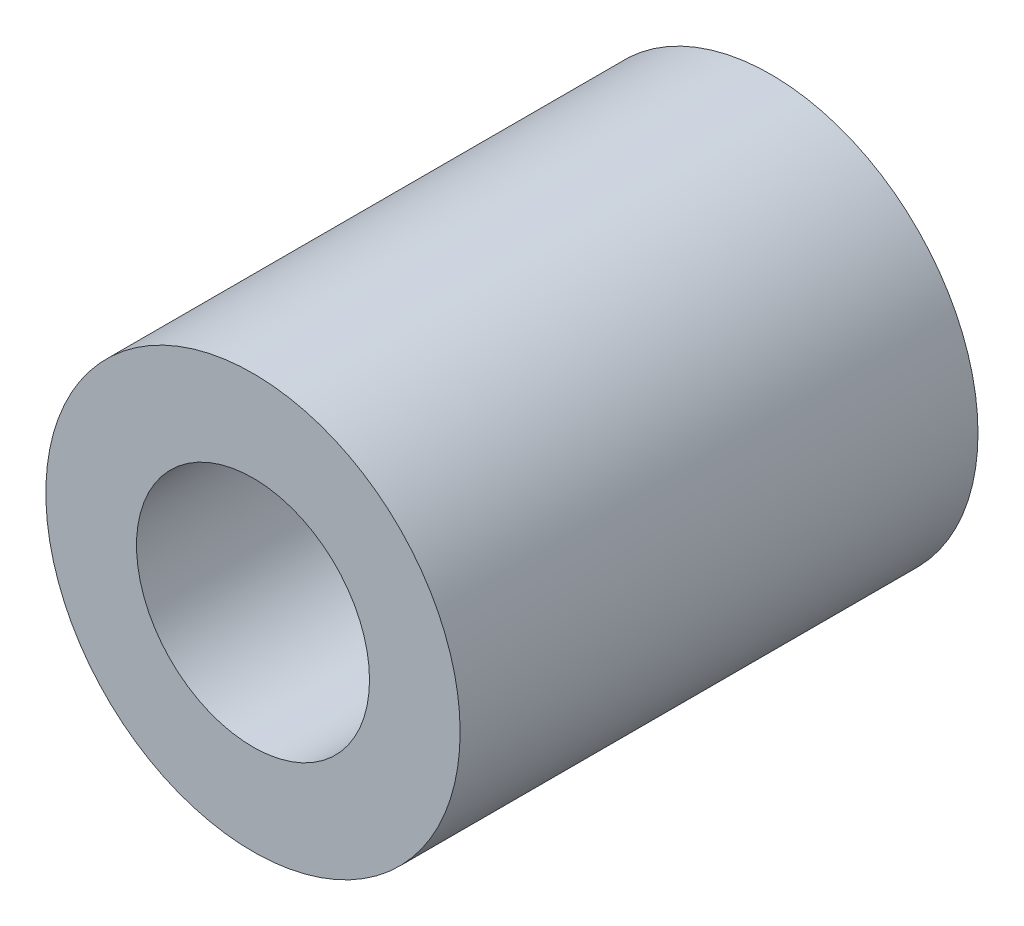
from build123d import *

# Parameters (mm, degrees)
SZKIC1_R                    = 4
SZKIC1_R_2                  = 2.25
DODANIE_WYCI_GNI_CIE1_DEPTH = 10


with BuildPart() as part:
    # Szkic1 → Dodanie-wyci_gni_cie1 (new body)
    with BuildSketch(Plane.XY):
        Circle(SZKIC1_R)
        Circle(SZKIC1_R_2, mode=Mode.SUBTRACT)
    extrude(amount=DODANIE_WYCI_GNI_CIE1_DEPTH)


solid = part.part
